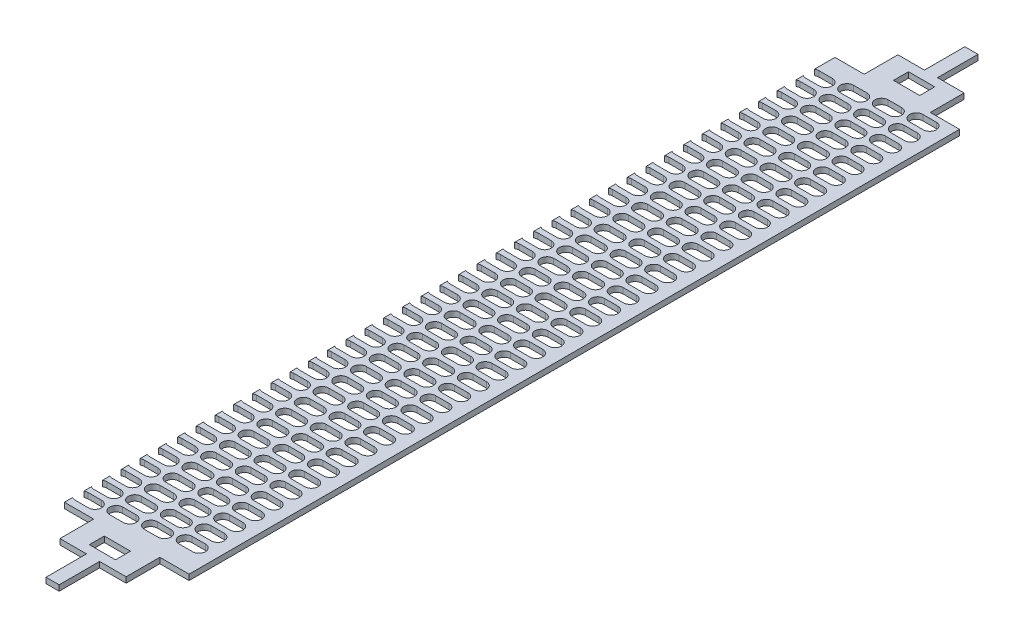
from build123d import *

# Parameters (mm, degrees)
CROQUIS1_W              = 14
CROQUIS1_H              = 8
SALIENTE_EXTRUIR1_DEPTH = 3


with BuildPart() as part:
    # Croquis1 → Saliente-Extruir1 (new body)
    with BuildSketch(Plane(origin=(0, 0, 0), x_dir=(1, 0, 0), z_dir=(0, 1, 0))):
        with BuildLine():
            Line((15.6, 411.2), (15.6, 429.2))
            Line((15.6, 429.2), (29.75, 429.2))
            Line((29.75, 429.2), (29.75, 450.8))
            Line((29.75, 450.8), (36.75, 450.8))
            Line((36.75, 450.8), (36.75, 429.2))
            Line((36.75, 429.2), (50.9, 429.2))
            Line((50.9, 429.2), (50.9, 411.2))
            Line((50.9, 411.2), (66.5, 411.2))
            Line((66.5, 411.2), (66.5, 0))
            Line((66.5, 0), (50.9, 0))
            Line((50.9, 0), (50.9, -18))
            Line((50.9, -18), (36.75, -18))
            Line((36.75, -18), (36.75, -39.6))
            Line((36.75, -39.6), (29.75, -39.6))
            Line((29.75, -39.6), (29.75, -18))
            Line((29.75, -18), (15.6, -18))
            Line((15.6, -18), (15.6, 0))
            Line((15.6, 0), (0, 0))
            Line((0, 0), (0, 4.298333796))
            ThreePointArc((0, 4.298333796), (0.866145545, 3.926883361), (1.8, 3.8))
            Line((1.8, 3.8), (9, 3.8))
            ThreePointArc((9, 3.8), (12.5, 7.3), (9, 10.8))
            Line((9, 10.8), (1.8, 10.8))
            ThreePointArc((1.8, 10.8), (0.866145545, 10.673116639), (0, 10.301666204))
            Line((0, 10.301666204), (0, 14.298333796))
            ThreePointArc((0, 14.298333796), (0.866145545, 13.926883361), (1.8, 13.8))
            Line((1.8, 13.8), (9, 13.8))
            ThreePointArc((9, 13.8), (12.5, 17.3), (9, 20.8))
            Line((9, 20.8), (1.8, 20.8))
            ThreePointArc((1.8, 20.8), (0.866145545, 20.673116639), (0, 20.301666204))
            Line((0, 20.301666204), (0, 24.298333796))
            ThreePointArc((0, 24.298333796), (0.866145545, 23.926883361), (1.8, 23.8))
            Line((1.8, 23.8), (9, 23.8))
            ThreePointArc((9, 23.8), (12.5, 27.3), (9, 30.8))
            Line((9, 30.8), (1.8, 30.8))
            ThreePointArc((1.8, 30.8), (0.866145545, 30.673116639), (0, 30.301666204))
            Line((0, 30.301666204), (0, 34.298333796))
            ThreePointArc((0, 34.298333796), (0.866145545, 33.926883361), (1.8, 33.8))
            Line((1.8, 33.8), (9, 33.8))
            ThreePointArc((9, 33.8), (12.5, 37.3), (9, 40.8))
            Line((9, 40.8), (1.8, 40.8))
            ThreePointArc((1.8, 40.8), (0.866145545, 40.673116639), (0, 40.301666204))
            Line((0, 40.301666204), (0, 44.298333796))
            ThreePointArc((0, 44.298333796), (0.866145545, 43.926883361), (1.8, 43.8))
            Line((1.8, 43.8), (9, 43.8))
            ThreePointArc((9, 43.8), (12.5, 47.3), (9, 50.8))
            Line((9, 50.8), (1.8, 50.8))
            ThreePointArc((1.8, 50.8), (0.866145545, 50.673116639), (0, 50.301666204))
            Line((0, 50.301666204), (0, 54.298333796))
            ThreePointArc((0, 54.298333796), (0.866145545, 53.926883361), (1.8, 53.8))
            Line((1.8, 53.8), (9, 53.8))
            ThreePointArc((9, 53.8), (12.5, 57.3), (9, 60.8))
            Line((9, 60.8), (1.8, 60.8))
            ThreePointArc((1.8, 60.8), (0.866145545, 60.673116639), (0, 60.301666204))
            Line((0, 60.301666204), (0, 64.298333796))
            ThreePointArc((0, 64.298333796), (0.866145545, 63.926883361), (1.8, 63.8))
            Line((1.8, 63.8), (9, 63.8))
            ThreePointArc((9, 63.8), (12.5, 67.3), (9, 70.8))
            Line((9, 70.8), (1.8, 70.8))
            ThreePointArc((1.8, 70.8), (0.866145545, 70.673116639), (0, 70.301666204))
            Line((0, 70.301666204), (0, 74.298333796))
            ThreePointArc((0, 74.298333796), (0.866145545, 73.926883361), (1.8, 73.8))
            Line((1.8, 73.8), (9, 73.8))
            ThreePointArc((9, 73.8), (12.5, 77.3), (9, 80.8))
            Line((9, 80.8), (1.8, 80.8))
            ThreePointArc((1.8, 80.8), (0.866145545, 80.673116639), (0, 80.301666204))
            Line((0, 80.301666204), (0, 84.298333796))
            ThreePointArc((0, 84.298333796), (0.866145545, 83.926883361), (1.8, 83.8))
            Line((1.8, 83.8), (9, 83.8))
            ThreePointArc((9, 83.8), (12.5, 87.3), (9, 90.8))
            Line((9, 90.8), (1.8, 90.8))
            ThreePointArc((1.8, 90.8), (0.866145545, 90.673116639), (0, 90.301666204))
            Line((0, 90.301666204), (0, 94.298333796))
            ThreePointArc((0, 94.298333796), (0.866145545, 93.926883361), (1.8, 93.8))
            Line((1.8, 93.8), (9, 93.8))
            ThreePointArc((9, 93.8), (12.5, 97.3), (9, 100.8))
            Line((9, 100.8), (1.8, 100.8))
            ThreePointArc((1.8, 100.8), (0.866145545, 100.673116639), (0, 100.301666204))
            Line((0, 100.301666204), (0, 104.298333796))
            ThreePointArc((0, 104.298333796), (0.866145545, 103.926883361), (1.8, 103.8))
            Line((1.8, 103.8), (9, 103.8))
            ThreePointArc((9, 103.8), (12.5, 107.3), (9, 110.8))
            Line((9, 110.8), (1.8, 110.8))
            ThreePointArc((1.8, 110.8), (0.866145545, 110.673116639), (0, 110.301666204))
            Line((0, 110.301666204), (0, 114.298333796))
            ThreePointArc((0, 114.298333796), (0.866145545, 113.926883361), (1.8, 113.8))
            Line((1.8, 113.8), (9, 113.8))
            ThreePointArc((9, 113.8), (12.5, 117.3), (9, 120.8))
            Line((9, 120.8), (1.8, 120.8))
            ThreePointArc((1.8, 120.8), (0.866145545, 120.673116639), (0, 120.301666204))
            Line((0, 120.301666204), (0, 124.298333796))
            ThreePointArc((0, 124.298333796), (0.866145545, 123.926883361), (1.8, 123.8))
            Line((1.8, 123.8), (9, 123.8))
            ThreePointArc((9, 123.8), (12.5, 127.3), (9, 130.8))
            Line((9, 130.8), (1.8, 130.8))
            ThreePointArc((1.8, 130.8), (0.866145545, 130.673116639), (0, 130.301666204))
            Line((0, 130.301666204), (0, 134.298333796))
            ThreePointArc((0, 134.298333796), (0.866145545, 133.926883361), (1.8, 133.8))
            Line((1.8, 133.8), (9, 133.8))
            ThreePointArc((9, 133.8), (12.5, 137.3), (9, 140.8))
            Line((9, 140.8), (1.8, 140.8))
            ThreePointArc((1.8, 140.8), (0.866145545, 140.673116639), (0, 140.301666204))
            Line((0, 140.301666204), (0, 144.298333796))
            ThreePointArc((0, 144.298333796), (0.866145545, 143.926883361), (1.8, 143.8))
            Line((1.8, 143.8), (9, 143.8))
            ThreePointArc((9, 143.8), (12.5, 147.3), (9, 150.8))
            Line((9, 150.8), (1.8, 150.8))
            ThreePointArc((1.8, 150.8), (0.866145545, 150.673116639), (0, 150.301666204))
            Line((0, 150.301666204), (0, 154.298333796))
            ThreePointArc((0, 154.298333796), (0.866145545, 153.926883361), (1.8, 153.8))
            Line((1.8, 153.8), (9, 153.8))
            ThreePointArc((9, 153.8), (12.5, 157.3), (9, 160.8))
            Line((9, 160.8), (1.8, 160.8))
            ThreePointArc((1.8, 160.8), (0.866145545, 160.673116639), (0, 160.301666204))
            Line((0, 160.301666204), (0, 164.298333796))
            ThreePointArc((0, 164.298333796), (0.866145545, 163.926883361), (1.8, 163.8))
            Line((1.8, 163.8), (9, 163.8))
            ThreePointArc((9, 163.8), (12.5, 167.3), (9, 170.8))
            Line((9, 170.8), (1.8, 170.8))
            ThreePointArc((1.8, 170.8), (0.866145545, 170.673116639), (0, 170.301666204))
            Line((0, 170.301666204), (0, 174.298333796))
            ThreePointArc((0, 174.298333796), (0.866145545, 173.926883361), (1.8, 173.8))
            Line((1.8, 173.8), (9, 173.8))
            ThreePointArc((9, 173.8), (12.5, 177.3), (9, 180.8))
            Line((9, 180.8), (1.8, 180.8))
            ThreePointArc((1.8, 180.8), (0.866145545, 180.673116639), (0, 180.301666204))
            Line((0, 180.301666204), (0, 184.298333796))
            ThreePointArc((0, 184.298333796), (0.866145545, 183.926883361), (1.8, 183.8))
            Line((1.8, 183.8), (9, 183.8))
            ThreePointArc((9, 183.8), (12.5, 187.3), (9, 190.8))
            Line((9, 190.8), (1.8, 190.8))
            ThreePointArc((1.8, 190.8), (0.866145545, 190.673116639), (0, 190.301666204))
            Line((0, 190.301666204), (0, 194.298333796))
            ThreePointArc((0, 194.298333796), (0.866145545, 193.926883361), (1.8, 193.8))
            Line((1.8, 193.8), (9, 193.8))
            ThreePointArc((9, 193.8), (12.5, 197.3), (9, 200.8))
            Line((9, 200.8), (1.8, 200.8))
            ThreePointArc((1.8, 200.8), (0.866145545, 200.673116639), (0, 200.301666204))
            Line((0, 200.301666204), (0, 204.298333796))
            ThreePointArc((0, 204.298333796), (0.866145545, 203.926883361), (1.8, 203.8))
            Line((1.8, 203.8), (9, 203.8))
            ThreePointArc((9, 203.8), (12.5, 207.3), (9, 210.8))
            Line((9, 210.8), (1.8, 210.8))
            ThreePointArc((1.8, 210.8), (0.866145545, 210.673116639), (0, 210.301666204))
            Line((0, 210.301666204), (0, 214.298333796))
            ThreePointArc((0, 214.298333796), (0.866145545, 213.926883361), (1.8, 213.8))
            Line((1.8, 213.8), (9, 213.8))
            ThreePointArc((9, 213.8), (12.5, 217.3), (9, 220.8))
            Line((9, 220.8), (1.8, 220.8))
            ThreePointArc((1.8, 220.8), (0.866145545, 220.673116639), (0, 220.301666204))
            Line((0, 220.301666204), (0, 224.298333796))
            ThreePointArc((0, 224.298333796), (0.866145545, 223.926883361), (1.8, 223.8))
            Line((1.8, 223.8), (9, 223.8))
            ThreePointArc((9, 223.8), (12.5, 227.3), (9, 230.8))
            Line((9, 230.8), (1.8, 230.8))
            ThreePointArc((1.8, 230.8), (0.866145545, 230.673116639), (0, 230.301666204))
            Line((0, 230.301666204), (0, 234.298333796))
            ThreePointArc((0, 234.298333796), (0.866145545, 233.926883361), (1.8, 233.8))
            Line((1.8, 233.8), (9, 233.8))
            ThreePointArc((9, 233.8), (12.5, 237.3), (9, 240.8))
            Line((9, 240.8), (1.8, 240.8))
            ThreePointArc((1.8, 240.8), (0.866145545, 240.673116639), (0, 240.301666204))
            Line((0, 240.301666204), (0, 244.298333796))
            ThreePointArc((0, 244.298333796), (0.866145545, 243.926883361), (1.8, 243.8))
            Line((1.8, 243.8), (9, 243.8))
            ThreePointArc((9, 243.8), (12.5, 247.3), (9, 250.8))
            Line((9, 250.8), (1.8, 250.8))
            ThreePointArc((1.8, 250.8), (0.866145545, 250.673116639), (0, 250.301666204))
            Line((0, 250.301666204), (0, 254.298333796))
            ThreePointArc((0, 254.298333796), (0.866145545, 253.926883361), (1.8, 253.8))
            Line((1.8, 253.8), (9, 253.8))
            ThreePointArc((9, 253.8), (12.5, 257.3), (9, 260.8))
            Line((9, 260.8), (1.8, 260.8))
            ThreePointArc((1.8, 260.8), (0.866145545, 260.673116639), (0, 260.301666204))
            Line((0, 260.301666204), (0, 264.298333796))
            ThreePointArc((0, 264.298333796), (0.866145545, 263.926883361), (1.8, 263.8))
            Line((1.8, 263.8), (9, 263.8))
            ThreePointArc((9, 263.8), (12.5, 267.3), (9, 270.8))
            Line((9, 270.8), (1.8, 270.8))
            ThreePointArc((1.8, 270.8), (0.866145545, 270.673116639), (0, 270.301666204))
            Line((0, 270.301666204), (0, 274.298333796))
            ThreePointArc((0, 274.298333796), (0.866145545, 273.926883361), (1.8, 273.8))
            Line((1.8, 273.8), (9, 273.8))
            ThreePointArc((9, 273.8), (12.5, 277.3), (9, 280.8))
            Line((9, 280.8), (1.8, 280.8))
            ThreePointArc((1.8, 280.8), (0.866145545, 280.673116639), (0, 280.301666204))
            Line((0, 280.301666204), (0, 284.298333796))
            ThreePointArc((0, 284.298333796), (0.866145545, 283.926883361), (1.8, 283.8))
            Line((1.8, 283.8), (9, 283.8))
            ThreePointArc((9, 283.8), (12.5, 287.3), (9, 290.8))
            Line((9, 290.8), (1.8, 290.8))
            ThreePointArc((1.8, 290.8), (0.866145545, 290.673116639), (0, 290.301666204))
            Line((0, 290.301666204), (0, 294.298333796))
            ThreePointArc((0, 294.298333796), (0.866145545, 293.926883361), (1.8, 293.8))
            Line((1.8, 293.8), (9, 293.8))
            ThreePointArc((9, 293.8), (12.5, 297.3), (9, 300.8))
            Line((9, 300.8), (1.8, 300.8))
            ThreePointArc((1.8, 300.8), (0.866145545, 300.673116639), (0, 300.301666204))
            Line((0, 300.301666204), (0, 304.298333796))
            ThreePointArc((0, 304.298333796), (0.866145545, 303.926883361), (1.8, 303.8))
            Line((1.8, 303.8), (9, 303.8))
            ThreePointArc((9, 303.8), (12.5, 307.3), (9, 310.8))
            Line((9, 310.8), (1.8, 310.8))
            ThreePointArc((1.8, 310.8), (0.866145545, 310.673116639), (0, 310.301666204))
            Line((0, 310.301666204), (0, 314.298333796))
            ThreePointArc((0, 314.298333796), (0.866145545, 313.926883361), (1.8, 313.8))
            Line((1.8, 313.8), (9, 313.8))
            ThreePointArc((9, 313.8), (12.5, 317.3), (9, 320.8))
            Line((9, 320.8), (1.8, 320.8))
            ThreePointArc((1.8, 320.8), (0.866145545, 320.673116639), (0, 320.301666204))
            Line((0, 320.301666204), (0, 324.298333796))
            ThreePointArc((0, 324.298333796), (0.866145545, 323.926883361), (1.8, 323.8))
            Line((1.8, 323.8), (9, 323.8))
            ThreePointArc((9, 323.8), (12.5, 327.3), (9, 330.8))
            Line((9, 330.8), (1.8, 330.8))
            ThreePointArc((1.8, 330.8), (0.866145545, 330.673116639), (0, 330.301666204))
            Line((0, 330.301666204), (0, 334.298333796))
            ThreePointArc((0, 334.298333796), (0.866145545, 333.926883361), (1.8, 333.8))
            Line((1.8, 333.8), (9, 333.8))
            ThreePointArc((9, 333.8), (12.5, 337.3), (9, 340.8))
            Line((9, 340.8), (1.8, 340.8))
            ThreePointArc((1.8, 340.8), (0.866145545, 340.673116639), (0, 340.301666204))
            Line((0, 340.301666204), (0, 344.298333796))
            ThreePointArc((0, 344.298333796), (0.866145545, 343.926883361), (1.8, 343.8))
            Line((1.8, 343.8), (9, 343.8))
            ThreePointArc((9, 343.8), (12.5, 347.3), (9, 350.8))
            Line((9, 350.8), (1.8, 350.8))
            ThreePointArc((1.8, 350.8), (0.866145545, 350.673116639), (0, 350.301666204))
            Line((0, 350.301666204), (0, 354.298333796))
            ThreePointArc((0, 354.298333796), (0.866145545, 353.926883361), (1.8, 353.8))
            Line((1.8, 353.8), (9, 353.8))
            ThreePointArc((9, 353.8), (12.5, 357.3), (9, 360.8))
            Line((9, 360.8), (1.8, 360.8))
            ThreePointArc((1.8, 360.8), (0.866145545, 360.673116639), (0, 360.301666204))
            Line((0, 360.301666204), (0, 364.298333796))
            ThreePointArc((0, 364.298333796), (0.866145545, 363.926883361), (1.8, 363.8))
            Line((1.8, 363.8), (9, 363.8))
            ThreePointArc((9, 363.8), (12.5, 367.3), (9, 370.8))
            Line((9, 370.8), (1.8, 370.8))
            ThreePointArc((1.8, 370.8), (0.866145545, 370.673116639), (0, 370.301666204))
            Line((0, 370.301666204), (0, 374.298333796))
            ThreePointArc((0, 374.298333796), (0.866145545, 373.926883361), (1.8, 373.8))
            Line((1.8, 373.8), (9, 373.8))
            ThreePointArc((9, 373.8), (12.5, 377.3), (9, 380.8))
            Line((9, 380.8), (1.8, 380.8))
            ThreePointArc((1.8, 380.8), (0.866145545, 380.673116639), (0, 380.301666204))
            Line((0, 380.301666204), (0, 384.298333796))
            ThreePointArc((0, 384.298333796), (0.866145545, 383.926883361), (1.8, 383.8))
            Line((1.8, 383.8), (9, 383.8))
            ThreePointArc((9, 383.8), (12.5, 387.3), (9, 390.8))
            Line((9, 390.8), (1.8, 390.8))
            ThreePointArc((1.8, 390.8), (0.866145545, 390.673116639), (0, 390.301666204))
            Line((0, 390.301666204), (0, 394.298333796))
            ThreePointArc((0, 394.298333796), (0.866145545, 393.926883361), (1.8, 393.8))
            Line((1.8, 393.8), (9, 393.8))
            ThreePointArc((9, 393.8), (12.5, 397.3), (9, 400.8))
            Line((9, 400.8), (1.8, 400.8))
            ThreePointArc((1.8, 400.8), (0.866145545, 400.673116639), (0, 400.301666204))
            Line((0, 400.301666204), (0, 411.2))
            Line((0, 411.2), (15.6, 411.2))
        make_face()
        with Locations((33.25, 420.2)):
            Rectangle(CROQUIS1_W, CROQUIS1_H, mode=Mode.SUBTRACT)
        with BuildLine():
            Line((49.8, 408.3), (57, 408.3))
            ThreePointArc((57, 408.3), (60.5, 404.8), (57, 401.3))
            Line((57, 401.3), (49.8, 401.3))
            ThreePointArc((49.8, 401.3), (46.3, 404.8), (49.8, 408.3))
        make_face(mode=Mode.SUBTRACT)
        with Locations((33.25, -9)):
            Rectangle(CROQUIS1_W, CROQUIS1_H, mode=Mode.SUBTRACT)
        with BuildLine():
            Line((33.8, 398.8), (41, 398.8))
            ThreePointArc((41, 398.8), (44.5, 402.3), (41, 405.8))
            Line((41, 405.8), (33.8, 405.8))
            ThreePointArc((33.8, 405.8), (30.3, 402.3), (33.8, 398.8))
        make_face(mode=Mode.SUBTRACT)
        with BuildLine():
            Line((17.8, 396.3), (25, 396.3))
            ThreePointArc((25, 396.3), (28.5, 399.8), (25, 403.3))
            Line((25, 403.3), (17.8, 403.3))
            ThreePointArc((17.8, 403.3), (14.3, 399.8), (17.8, 396.3))
        make_face(mode=Mode.SUBTRACT)
        with BuildLine():
            Line((49.8, 398.3), (57, 398.3))
            ThreePointArc((57, 398.3), (60.5, 394.8), (57, 391.3))
            Line((57, 391.3), (49.8, 391.3))
            ThreePointArc((49.8, 391.3), (46.3, 394.8), (49.8, 398.3))
        make_face(mode=Mode.SUBTRACT)
        with BuildLine():
            Line((33.8, 395.8), (41, 395.8))
            ThreePointArc((41, 395.8), (44.5, 392.3), (41, 388.8))
            Line((41, 388.8), (33.8, 388.8))
            ThreePointArc((33.8, 388.8), (30.3, 392.3), (33.8, 395.8))
        make_face(mode=Mode.SUBTRACT)
        with BuildLine():
            Line((17.8, 393.3), (25, 393.3))
            ThreePointArc((25, 393.3), (28.5, 389.8), (25, 386.3))
            Line((25, 386.3), (17.8, 386.3))
            ThreePointArc((17.8, 386.3), (14.3, 389.8), (17.8, 393.3))
        make_face(mode=Mode.SUBTRACT)
        with BuildLine():
            Line((49.8, 388.3), (57, 388.3))
            ThreePointArc((57, 388.3), (60.5, 384.8), (57, 381.3))
            Line((57, 381.3), (49.8, 381.3))
            ThreePointArc((49.8, 381.3), (46.3, 384.8), (49.8, 388.3))
        make_face(mode=Mode.SUBTRACT)
        with BuildLine():
            Line((33.8, 385.8), (41, 385.8))
            ThreePointArc((41, 385.8), (44.5, 382.3), (41, 378.8))
            Line((41, 378.8), (33.8, 378.8))
            ThreePointArc((33.8, 378.8), (30.3, 382.3), (33.8, 385.8))
        make_face(mode=Mode.SUBTRACT)
        with BuildLine():
            Line((17.8, 383.3), (25, 383.3))
            ThreePointArc((25, 383.3), (28.5, 379.8), (25, 376.3))
            Line((25, 376.3), (17.8, 376.3))
            ThreePointArc((17.8, 376.3), (14.3, 379.8), (17.8, 383.3))
        make_face(mode=Mode.SUBTRACT)
        with BuildLine():
            Line((49.8, 378.3), (57, 378.3))
            ThreePointArc((57, 378.3), (60.5, 374.8), (57, 371.3))
            Line((57, 371.3), (49.8, 371.3))
            ThreePointArc((49.8, 371.3), (46.3, 374.8), (49.8, 378.3))
        make_face(mode=Mode.SUBTRACT)
        with BuildLine():
            Line((33.8, 375.8), (41, 375.8))
            ThreePointArc((41, 375.8), (44.5, 372.3), (41, 368.8))
            Line((41, 368.8), (33.8, 368.8))
            ThreePointArc((33.8, 368.8), (30.3, 372.3), (33.8, 375.8))
        make_face(mode=Mode.SUBTRACT)
        with BuildLine():
            Line((17.8, 373.3), (25, 373.3))
            ThreePointArc((25, 373.3), (28.5, 369.8), (25, 366.3))
            Line((25, 366.3), (17.8, 366.3))
            ThreePointArc((17.8, 366.3), (14.3, 369.8), (17.8, 373.3))
        make_face(mode=Mode.SUBTRACT)
        with BuildLine():
            Line((49.8, 368.3), (57, 368.3))
            ThreePointArc((57, 368.3), (60.5, 364.8), (57, 361.3))
            Line((57, 361.3), (49.8, 361.3))
            ThreePointArc((49.8, 361.3), (46.3, 364.8), (49.8, 368.3))
        make_face(mode=Mode.SUBTRACT)
        with BuildLine():
            Line((33.8, 365.8), (41, 365.8))
            ThreePointArc((41, 365.8), (44.5, 362.3), (41, 358.8))
            Line((41, 358.8), (33.8, 358.8))
            ThreePointArc((33.8, 358.8), (30.3, 362.3), (33.8, 365.8))
        make_face(mode=Mode.SUBTRACT)
        with BuildLine():
            Line((17.8, 363.3), (25, 363.3))
            ThreePointArc((25, 363.3), (28.5, 359.8), (25, 356.3))
            Line((25, 356.3), (17.8, 356.3))
            ThreePointArc((17.8, 356.3), (14.3, 359.8), (17.8, 363.3))
        make_face(mode=Mode.SUBTRACT)
        with BuildLine():
            Line((49.8, 358.3), (57, 358.3))
            ThreePointArc((57, 358.3), (60.5, 354.8), (57, 351.3))
            Line((57, 351.3), (49.8, 351.3))
            ThreePointArc((49.8, 351.3), (46.3, 354.8), (49.8, 358.3))
        make_face(mode=Mode.SUBTRACT)
        with BuildLine():
            Line((33.8, 355.8), (41, 355.8))
            ThreePointArc((41, 355.8), (44.5, 352.3), (41, 348.8))
            Line((41, 348.8), (33.8, 348.8))
            ThreePointArc((33.8, 348.8), (30.3, 352.3), (33.8, 355.8))
        make_face(mode=Mode.SUBTRACT)
        with BuildLine():
            Line((17.8, 353.3), (25, 353.3))
            ThreePointArc((25, 353.3), (28.5, 349.8), (25, 346.3))
            Line((25, 346.3), (17.8, 346.3))
            ThreePointArc((17.8, 346.3), (14.3, 349.8), (17.8, 353.3))
        make_face(mode=Mode.SUBTRACT)
        with BuildLine():
            Line((49.8, 348.3), (57, 348.3))
            ThreePointArc((57, 348.3), (60.5, 344.8), (57, 341.3))
            Line((57, 341.3), (49.8, 341.3))
            ThreePointArc((49.8, 341.3), (46.3, 344.8), (49.8, 348.3))
        make_face(mode=Mode.SUBTRACT)
        with BuildLine():
            Line((33.8, 345.8), (41, 345.8))
            ThreePointArc((41, 345.8), (44.5, 342.3), (41, 338.8))
            Line((41, 338.8), (33.8, 338.8))
            ThreePointArc((33.8, 338.8), (30.3, 342.3), (33.8, 345.8))
        make_face(mode=Mode.SUBTRACT)
        with BuildLine():
            Line((17.8, 343.3), (25, 343.3))
            ThreePointArc((25, 343.3), (28.5, 339.8), (25, 336.3))
            Line((25, 336.3), (17.8, 336.3))
            ThreePointArc((17.8, 336.3), (14.3, 339.8), (17.8, 343.3))
        make_face(mode=Mode.SUBTRACT)
        with BuildLine():
            Line((49.8, 338.3), (57, 338.3))
            ThreePointArc((57, 338.3), (60.5, 334.8), (57, 331.3))
            Line((57, 331.3), (49.8, 331.3))
            ThreePointArc((49.8, 331.3), (46.3, 334.8), (49.8, 338.3))
        make_face(mode=Mode.SUBTRACT)
        with BuildLine():
            Line((33.8, 335.8), (41, 335.8))
            ThreePointArc((41, 335.8), (44.5, 332.3), (41, 328.8))
            Line((41, 328.8), (33.8, 328.8))
            ThreePointArc((33.8, 328.8), (30.3, 332.3), (33.8, 335.8))
        make_face(mode=Mode.SUBTRACT)
        with BuildLine():
            Line((17.8, 333.3), (25, 333.3))
            ThreePointArc((25, 333.3), (28.5, 329.8), (25, 326.3))
            Line((25, 326.3), (17.8, 326.3))
            ThreePointArc((17.8, 326.3), (14.3, 329.8), (17.8, 333.3))
        make_face(mode=Mode.SUBTRACT)
        with BuildLine():
            Line((49.8, 328.3), (57, 328.3))
            ThreePointArc((57, 328.3), (60.5, 324.8), (57, 321.3))
            Line((57, 321.3), (49.8, 321.3))
            ThreePointArc((49.8, 321.3), (46.3, 324.8), (49.8, 328.3))
        make_face(mode=Mode.SUBTRACT)
        with BuildLine():
            Line((33.8, 325.8), (41, 325.8))
            ThreePointArc((41, 325.8), (44.5, 322.3), (41, 318.8))
            Line((41, 318.8), (33.8, 318.8))
            ThreePointArc((33.8, 318.8), (30.3, 322.3), (33.8, 325.8))
        make_face(mode=Mode.SUBTRACT)
        with BuildLine():
            Line((17.8, 323.3), (25, 323.3))
            ThreePointArc((25, 323.3), (28.5, 319.8), (25, 316.3))
            Line((25, 316.3), (17.8, 316.3))
            ThreePointArc((17.8, 316.3), (14.3, 319.8), (17.8, 323.3))
        make_face(mode=Mode.SUBTRACT)
        with BuildLine():
            Line((49.8, 318.3), (57, 318.3))
            ThreePointArc((57, 318.3), (60.5, 314.8), (57, 311.3))
            Line((57, 311.3), (49.8, 311.3))
            ThreePointArc((49.8, 311.3), (46.3, 314.8), (49.8, 318.3))
        make_face(mode=Mode.SUBTRACT)
        with BuildLine():
            Line((33.8, 315.8), (41, 315.8))
            ThreePointArc((41, 315.8), (44.5, 312.3), (41, 308.8))
            Line((41, 308.8), (33.8, 308.8))
            ThreePointArc((33.8, 308.8), (30.3, 312.3), (33.8, 315.8))
        make_face(mode=Mode.SUBTRACT)
        with BuildLine():
            Line((17.8, 313.3), (25, 313.3))
            ThreePointArc((25, 313.3), (28.5, 309.8), (25, 306.3))
            Line((25, 306.3), (17.8, 306.3))
            ThreePointArc((17.8, 306.3), (14.3, 309.8), (17.8, 313.3))
        make_face(mode=Mode.SUBTRACT)
        with BuildLine():
            Line((49.8, 308.3), (57, 308.3))
            ThreePointArc((57, 308.3), (60.5, 304.8), (57, 301.3))
            Line((57, 301.3), (49.8, 301.3))
            ThreePointArc((49.8, 301.3), (46.3, 304.8), (49.8, 308.3))
        make_face(mode=Mode.SUBTRACT)
        with BuildLine():
            Line((33.8, 305.8), (41, 305.8))
            ThreePointArc((41, 305.8), (44.5, 302.3), (41, 298.8))
            Line((41, 298.8), (33.8, 298.8))
            ThreePointArc((33.8, 298.8), (30.3, 302.3), (33.8, 305.8))
        make_face(mode=Mode.SUBTRACT)
        with BuildLine():
            Line((17.8, 303.3), (25, 303.3))
            ThreePointArc((25, 303.3), (28.5, 299.8), (25, 296.3))
            Line((25, 296.3), (17.8, 296.3))
            ThreePointArc((17.8, 296.3), (14.3, 299.8), (17.8, 303.3))
        make_face(mode=Mode.SUBTRACT)
        with BuildLine():
            Line((49.8, 298.3), (57, 298.3))
            ThreePointArc((57, 298.3), (60.5, 294.8), (57, 291.3))
            Line((57, 291.3), (49.8, 291.3))
            ThreePointArc((49.8, 291.3), (46.3, 294.8), (49.8, 298.3))
        make_face(mode=Mode.SUBTRACT)
        with BuildLine():
            Line((33.8, 295.8), (41, 295.8))
            ThreePointArc((41, 295.8), (44.5, 292.3), (41, 288.8))
            Line((41, 288.8), (33.8, 288.8))
            ThreePointArc((33.8, 288.8), (30.3, 292.3), (33.8, 295.8))
        make_face(mode=Mode.SUBTRACT)
        with BuildLine():
            Line((17.8, 293.3), (25, 293.3))
            ThreePointArc((25, 293.3), (28.5, 289.8), (25, 286.3))
            Line((25, 286.3), (17.8, 286.3))
            ThreePointArc((17.8, 286.3), (14.3, 289.8), (17.8, 293.3))
        make_face(mode=Mode.SUBTRACT)
        with BuildLine():
            Line((49.8, 288.3), (57, 288.3))
            ThreePointArc((57, 288.3), (60.5, 284.8), (57, 281.3))
            Line((57, 281.3), (49.8, 281.3))
            ThreePointArc((49.8, 281.3), (46.3, 284.8), (49.8, 288.3))
        make_face(mode=Mode.SUBTRACT)
        with BuildLine():
            Line((33.8, 285.8), (41, 285.8))
            ThreePointArc((41, 285.8), (44.5, 282.3), (41, 278.8))
            Line((41, 278.8), (33.8, 278.8))
            ThreePointArc((33.8, 278.8), (30.3, 282.3), (33.8, 285.8))
        make_face(mode=Mode.SUBTRACT)
        with BuildLine():
            Line((17.8, 283.3), (25, 283.3))
            ThreePointArc((25, 283.3), (28.5, 279.8), (25, 276.3))
            Line((25, 276.3), (17.8, 276.3))
            ThreePointArc((17.8, 276.3), (14.3, 279.8), (17.8, 283.3))
        make_face(mode=Mode.SUBTRACT)
        with BuildLine():
            Line((49.8, 278.3), (57, 278.3))
            ThreePointArc((57, 278.3), (60.5, 274.8), (57, 271.3))
            Line((57, 271.3), (49.8, 271.3))
            ThreePointArc((49.8, 271.3), (46.3, 274.8), (49.8, 278.3))
        make_face(mode=Mode.SUBTRACT)
        with BuildLine():
            Line((33.8, 275.8), (41, 275.8))
            ThreePointArc((41, 275.8), (44.5, 272.3), (41, 268.8))
            Line((41, 268.8), (33.8, 268.8))
            ThreePointArc((33.8, 268.8), (30.3, 272.3), (33.8, 275.8))
        make_face(mode=Mode.SUBTRACT)
        with BuildLine():
            Line((17.8, 273.3), (25, 273.3))
            ThreePointArc((25, 273.3), (28.5, 269.8), (25, 266.3))
            Line((25, 266.3), (17.8, 266.3))
            ThreePointArc((17.8, 266.3), (14.3, 269.8), (17.8, 273.3))
        make_face(mode=Mode.SUBTRACT)
        with BuildLine():
            Line((49.8, 268.3), (57, 268.3))
            ThreePointArc((57, 268.3), (60.5, 264.8), (57, 261.3))
            Line((57, 261.3), (49.8, 261.3))
            ThreePointArc((49.8, 261.3), (46.3, 264.8), (49.8, 268.3))
        make_face(mode=Mode.SUBTRACT)
        with BuildLine():
            Line((33.8, 265.8), (41, 265.8))
            ThreePointArc((41, 265.8), (44.5, 262.3), (41, 258.8))
            Line((41, 258.8), (33.8, 258.8))
            ThreePointArc((33.8, 258.8), (30.3, 262.3), (33.8, 265.8))
        make_face(mode=Mode.SUBTRACT)
        with BuildLine():
            Line((17.8, 263.3), (25, 263.3))
            ThreePointArc((25, 263.3), (28.5, 259.8), (25, 256.3))
            Line((25, 256.3), (17.8, 256.3))
            ThreePointArc((17.8, 256.3), (14.3, 259.8), (17.8, 263.3))
        make_face(mode=Mode.SUBTRACT)
        with BuildLine():
            Line((49.8, 258.3), (57, 258.3))
            ThreePointArc((57, 258.3), (60.5, 254.8), (57, 251.3))
            Line((57, 251.3), (49.8, 251.3))
            ThreePointArc((49.8, 251.3), (46.3, 254.8), (49.8, 258.3))
        make_face(mode=Mode.SUBTRACT)
        with BuildLine():
            Line((33.8, 255.8), (41, 255.8))
            ThreePointArc((41, 255.8), (44.5, 252.3), (41, 248.8))
            Line((41, 248.8), (33.8, 248.8))
            ThreePointArc((33.8, 248.8), (30.3, 252.3), (33.8, 255.8))
        make_face(mode=Mode.SUBTRACT)
        with BuildLine():
            Line((17.8, 253.3), (25, 253.3))
            ThreePointArc((25, 253.3), (28.5, 249.8), (25, 246.3))
            Line((25, 246.3), (17.8, 246.3))
            ThreePointArc((17.8, 246.3), (14.3, 249.8), (17.8, 253.3))
        make_face(mode=Mode.SUBTRACT)
        with BuildLine():
            Line((49.8, 248.3), (57, 248.3))
            ThreePointArc((57, 248.3), (60.5, 244.8), (57, 241.3))
            Line((57, 241.3), (49.8, 241.3))
            ThreePointArc((49.8, 241.3), (46.3, 244.8), (49.8, 248.3))
        make_face(mode=Mode.SUBTRACT)
        with BuildLine():
            Line((33.8, 245.8), (41, 245.8))
            ThreePointArc((41, 245.8), (44.5, 242.3), (41, 238.8))
            Line((41, 238.8), (33.8, 238.8))
            ThreePointArc((33.8, 238.8), (30.3, 242.3), (33.8, 245.8))
        make_face(mode=Mode.SUBTRACT)
        with BuildLine():
            Line((17.8, 243.3), (25, 243.3))
            ThreePointArc((25, 243.3), (28.5, 239.8), (25, 236.3))
            Line((25, 236.3), (17.8, 236.3))
            ThreePointArc((17.8, 236.3), (14.3, 239.8), (17.8, 243.3))
        make_face(mode=Mode.SUBTRACT)
        with BuildLine():
            Line((49.8, 238.3), (57, 238.3))
            ThreePointArc((57, 238.3), (60.5, 234.8), (57, 231.3))
            Line((57, 231.3), (49.8, 231.3))
            ThreePointArc((49.8, 231.3), (46.3, 234.8), (49.8, 238.3))
        make_face(mode=Mode.SUBTRACT)
        with BuildLine():
            Line((33.8, 235.8), (41, 235.8))
            ThreePointArc((41, 235.8), (44.5, 232.3), (41, 228.8))
            Line((41, 228.8), (33.8, 228.8))
            ThreePointArc((33.8, 228.8), (30.3, 232.3), (33.8, 235.8))
        make_face(mode=Mode.SUBTRACT)
        with BuildLine():
            Line((17.8, 233.3), (25, 233.3))
            ThreePointArc((25, 233.3), (28.5, 229.8), (25, 226.3))
            Line((25, 226.3), (17.8, 226.3))
            ThreePointArc((17.8, 226.3), (14.3, 229.8), (17.8, 233.3))
        make_face(mode=Mode.SUBTRACT)
        with BuildLine():
            Line((49.8, 228.3), (57, 228.3))
            ThreePointArc((57, 228.3), (60.5, 224.8), (57, 221.3))
            Line((57, 221.3), (49.8, 221.3))
            ThreePointArc((49.8, 221.3), (46.3, 224.8), (49.8, 228.3))
        make_face(mode=Mode.SUBTRACT)
        with BuildLine():
            Line((33.8, 225.8), (41, 225.8))
            ThreePointArc((41, 225.8), (44.5, 222.3), (41, 218.8))
            Line((41, 218.8), (33.8, 218.8))
            ThreePointArc((33.8, 218.8), (30.3, 222.3), (33.8, 225.8))
        make_face(mode=Mode.SUBTRACT)
        with BuildLine():
            Line((17.8, 223.3), (25, 223.3))
            ThreePointArc((25, 223.3), (28.5, 219.8), (25, 216.3))
            Line((25, 216.3), (17.8, 216.3))
            ThreePointArc((17.8, 216.3), (14.3, 219.8), (17.8, 223.3))
        make_face(mode=Mode.SUBTRACT)
        with BuildLine():
            Line((49.8, 218.3), (57, 218.3))
            ThreePointArc((57, 218.3), (60.5, 214.8), (57, 211.3))
            Line((57, 211.3), (49.8, 211.3))
            ThreePointArc((49.8, 211.3), (46.3, 214.8), (49.8, 218.3))
        make_face(mode=Mode.SUBTRACT)
        with BuildLine():
            Line((33.8, 215.8), (41, 215.8))
            ThreePointArc((41, 215.8), (44.5, 212.3), (41, 208.8))
            Line((41, 208.8), (33.8, 208.8))
            ThreePointArc((33.8, 208.8), (30.3, 212.3), (33.8, 215.8))
        make_face(mode=Mode.SUBTRACT)
        with BuildLine():
            Line((17.8, 213.3), (25, 213.3))
            ThreePointArc((25, 213.3), (28.5, 209.8), (25, 206.3))
            Line((25, 206.3), (17.8, 206.3))
            ThreePointArc((17.8, 206.3), (14.3, 209.8), (17.8, 213.3))
        make_face(mode=Mode.SUBTRACT)
        with BuildLine():
            Line((49.8, 208.3), (57, 208.3))
            ThreePointArc((57, 208.3), (60.5, 204.8), (57, 201.3))
            Line((57, 201.3), (49.8, 201.3))
            ThreePointArc((49.8, 201.3), (46.3, 204.8), (49.8, 208.3))
        make_face(mode=Mode.SUBTRACT)
        with BuildLine():
            Line((33.8, 205.8), (41, 205.8))
            ThreePointArc((41, 205.8), (44.5, 202.3), (41, 198.8))
            Line((41, 198.8), (33.8, 198.8))
            ThreePointArc((33.8, 198.8), (30.3, 202.3), (33.8, 205.8))
        make_face(mode=Mode.SUBTRACT)
        with BuildLine():
            Line((17.8, 203.3), (25, 203.3))
            ThreePointArc((25, 203.3), (28.5, 199.8), (25, 196.3))
            Line((25, 196.3), (17.8, 196.3))
            ThreePointArc((17.8, 196.3), (14.3, 199.8), (17.8, 203.3))
        make_face(mode=Mode.SUBTRACT)
        with BuildLine():
            Line((49.8, 198.3), (57, 198.3))
            ThreePointArc((57, 198.3), (60.5, 194.8), (57, 191.3))
            Line((57, 191.3), (49.8, 191.3))
            ThreePointArc((49.8, 191.3), (46.3, 194.8), (49.8, 198.3))
        make_face(mode=Mode.SUBTRACT)
        with BuildLine():
            Line((33.8, 195.8), (41, 195.8))
            ThreePointArc((41, 195.8), (44.5, 192.3), (41, 188.8))
            Line((41, 188.8), (33.8, 188.8))
            ThreePointArc((33.8, 188.8), (30.3, 192.3), (33.8, 195.8))
        make_face(mode=Mode.SUBTRACT)
        with BuildLine():
            Line((17.8, 193.3), (25, 193.3))
            ThreePointArc((25, 193.3), (28.5, 189.8), (25, 186.3))
            Line((25, 186.3), (17.8, 186.3))
            ThreePointArc((17.8, 186.3), (14.3, 189.8), (17.8, 193.3))
        make_face(mode=Mode.SUBTRACT)
        with BuildLine():
            Line((49.8, 188.3), (57, 188.3))
            ThreePointArc((57, 188.3), (60.5, 184.8), (57, 181.3))
            Line((57, 181.3), (49.8, 181.3))
            ThreePointArc((49.8, 181.3), (46.3, 184.8), (49.8, 188.3))
        make_face(mode=Mode.SUBTRACT)
        with BuildLine():
            Line((33.8, 185.8), (41, 185.8))
            ThreePointArc((41, 185.8), (44.5, 182.3), (41, 178.8))
            Line((41, 178.8), (33.8, 178.8))
            ThreePointArc((33.8, 178.8), (30.3, 182.3), (33.8, 185.8))
        make_face(mode=Mode.SUBTRACT)
        with BuildLine():
            Line((17.8, 183.3), (25, 183.3))
            ThreePointArc((25, 183.3), (28.5, 179.8), (25, 176.3))
            Line((25, 176.3), (17.8, 176.3))
            ThreePointArc((17.8, 176.3), (14.3, 179.8), (17.8, 183.3))
        make_face(mode=Mode.SUBTRACT)
        with BuildLine():
            Line((49.8, 178.3), (57, 178.3))
            ThreePointArc((57, 178.3), (60.5, 174.8), (57, 171.3))
            Line((57, 171.3), (49.8, 171.3))
            ThreePointArc((49.8, 171.3), (46.3, 174.8), (49.8, 178.3))
        make_face(mode=Mode.SUBTRACT)
        with BuildLine():
            Line((33.8, 175.8), (41, 175.8))
            ThreePointArc((41, 175.8), (44.5, 172.3), (41, 168.8))
            Line((41, 168.8), (33.8, 168.8))
            ThreePointArc((33.8, 168.8), (30.3, 172.3), (33.8, 175.8))
        make_face(mode=Mode.SUBTRACT)
        with BuildLine():
            Line((17.8, 173.3), (25, 173.3))
            ThreePointArc((25, 173.3), (28.5, 169.8), (25, 166.3))
            Line((25, 166.3), (17.8, 166.3))
            ThreePointArc((17.8, 166.3), (14.3, 169.8), (17.8, 173.3))
        make_face(mode=Mode.SUBTRACT)
        with BuildLine():
            Line((49.8, 168.3), (57, 168.3))
            ThreePointArc((57, 168.3), (60.5, 164.8), (57, 161.3))
            Line((57, 161.3), (49.8, 161.3))
            ThreePointArc((49.8, 161.3), (46.3, 164.8), (49.8, 168.3))
        make_face(mode=Mode.SUBTRACT)
        with BuildLine():
            Line((33.8, 165.8), (41, 165.8))
            ThreePointArc((41, 165.8), (44.5, 162.3), (41, 158.8))
            Line((41, 158.8), (33.8, 158.8))
            ThreePointArc((33.8, 158.8), (30.3, 162.3), (33.8, 165.8))
        make_face(mode=Mode.SUBTRACT)
        with BuildLine():
            Line((17.8, 163.3), (25, 163.3))
            ThreePointArc((25, 163.3), (28.5, 159.8), (25, 156.3))
            Line((25, 156.3), (17.8, 156.3))
            ThreePointArc((17.8, 156.3), (14.3, 159.8), (17.8, 163.3))
        make_face(mode=Mode.SUBTRACT)
        with BuildLine():
            Line((49.8, 158.3), (57, 158.3))
            ThreePointArc((57, 158.3), (60.5, 154.8), (57, 151.3))
            Line((57, 151.3), (49.8, 151.3))
            ThreePointArc((49.8, 151.3), (46.3, 154.8), (49.8, 158.3))
        make_face(mode=Mode.SUBTRACT)
        with BuildLine():
            Line((33.8, 155.8), (41, 155.8))
            ThreePointArc((41, 155.8), (44.5, 152.3), (41, 148.8))
            Line((41, 148.8), (33.8, 148.8))
            ThreePointArc((33.8, 148.8), (30.3, 152.3), (33.8, 155.8))
        make_face(mode=Mode.SUBTRACT)
        with BuildLine():
            Line((17.8, 153.3), (25, 153.3))
            ThreePointArc((25, 153.3), (28.5, 149.8), (25, 146.3))
            Line((25, 146.3), (17.8, 146.3))
            ThreePointArc((17.8, 146.3), (14.3, 149.8), (17.8, 153.3))
        make_face(mode=Mode.SUBTRACT)
        with BuildLine():
            Line((49.8, 148.3), (57, 148.3))
            ThreePointArc((57, 148.3), (60.5, 144.8), (57, 141.3))
            Line((57, 141.3), (49.8, 141.3))
            ThreePointArc((49.8, 141.3), (46.3, 144.8), (49.8, 148.3))
        make_face(mode=Mode.SUBTRACT)
        with BuildLine():
            Line((33.8, 145.8), (41, 145.8))
            ThreePointArc((41, 145.8), (44.5, 142.3), (41, 138.8))
            Line((41, 138.8), (33.8, 138.8))
            ThreePointArc((33.8, 138.8), (30.3, 142.3), (33.8, 145.8))
        make_face(mode=Mode.SUBTRACT)
        with BuildLine():
            Line((17.8, 143.3), (25, 143.3))
            ThreePointArc((25, 143.3), (28.5, 139.8), (25, 136.3))
            Line((25, 136.3), (17.8, 136.3))
            ThreePointArc((17.8, 136.3), (14.3, 139.8), (17.8, 143.3))
        make_face(mode=Mode.SUBTRACT)
        with BuildLine():
            Line((49.8, 138.3), (57, 138.3))
            ThreePointArc((57, 138.3), (60.5, 134.8), (57, 131.3))
            Line((57, 131.3), (49.8, 131.3))
            ThreePointArc((49.8, 131.3), (46.3, 134.8), (49.8, 138.3))
        make_face(mode=Mode.SUBTRACT)
        with BuildLine():
            Line((33.8, 135.8), (41, 135.8))
            ThreePointArc((41, 135.8), (44.5, 132.3), (41, 128.8))
            Line((41, 128.8), (33.8, 128.8))
            ThreePointArc((33.8, 128.8), (30.3, 132.3), (33.8, 135.8))
        make_face(mode=Mode.SUBTRACT)
        with BuildLine():
            Line((17.8, 133.3), (25, 133.3))
            ThreePointArc((25, 133.3), (28.5, 129.8), (25, 126.3))
            Line((25, 126.3), (17.8, 126.3))
            ThreePointArc((17.8, 126.3), (14.3, 129.8), (17.8, 133.3))
        make_face(mode=Mode.SUBTRACT)
        with BuildLine():
            Line((49.8, 128.3), (57, 128.3))
            ThreePointArc((57, 128.3), (60.5, 124.8), (57, 121.3))
            Line((57, 121.3), (49.8, 121.3))
            ThreePointArc((49.8, 121.3), (46.3, 124.8), (49.8, 128.3))
        make_face(mode=Mode.SUBTRACT)
        with BuildLine():
            Line((33.8, 125.8), (41, 125.8))
            ThreePointArc((41, 125.8), (44.5, 122.3), (41, 118.8))
            Line((41, 118.8), (33.8, 118.8))
            ThreePointArc((33.8, 118.8), (30.3, 122.3), (33.8, 125.8))
        make_face(mode=Mode.SUBTRACT)
        with BuildLine():
            Line((17.8, 123.3), (25, 123.3))
            ThreePointArc((25, 123.3), (28.5, 119.8), (25, 116.3))
            Line((25, 116.3), (17.8, 116.3))
            ThreePointArc((17.8, 116.3), (14.3, 119.8), (17.8, 123.3))
        make_face(mode=Mode.SUBTRACT)
        with BuildLine():
            Line((49.8, 118.3), (57, 118.3))
            ThreePointArc((57, 118.3), (60.5, 114.8), (57, 111.3))
            Line((57, 111.3), (49.8, 111.3))
            ThreePointArc((49.8, 111.3), (46.3, 114.8), (49.8, 118.3))
        make_face(mode=Mode.SUBTRACT)
        with BuildLine():
            Line((33.8, 115.8), (41, 115.8))
            ThreePointArc((41, 115.8), (44.5, 112.3), (41, 108.8))
            Line((41, 108.8), (33.8, 108.8))
            ThreePointArc((33.8, 108.8), (30.3, 112.3), (33.8, 115.8))
        make_face(mode=Mode.SUBTRACT)
        with BuildLine():
            Line((17.8, 113.3), (25, 113.3))
            ThreePointArc((25, 113.3), (28.5, 109.8), (25, 106.3))
            Line((25, 106.3), (17.8, 106.3))
            ThreePointArc((17.8, 106.3), (14.3, 109.8), (17.8, 113.3))
        make_face(mode=Mode.SUBTRACT)
        with BuildLine():
            Line((49.8, 108.3), (57, 108.3))
            ThreePointArc((57, 108.3), (60.5, 104.8), (57, 101.3))
            Line((57, 101.3), (49.8, 101.3))
            ThreePointArc((49.8, 101.3), (46.3, 104.8), (49.8, 108.3))
        make_face(mode=Mode.SUBTRACT)
        with BuildLine():
            Line((33.8, 105.8), (41, 105.8))
            ThreePointArc((41, 105.8), (44.5, 102.3), (41, 98.8))
            Line((41, 98.8), (33.8, 98.8))
            ThreePointArc((33.8, 98.8), (30.3, 102.3), (33.8, 105.8))
        make_face(mode=Mode.SUBTRACT)
        with BuildLine():
            Line((17.8, 103.3), (25, 103.3))
            ThreePointArc((25, 103.3), (28.5, 99.8), (25, 96.3))
            Line((25, 96.3), (17.8, 96.3))
            ThreePointArc((17.8, 96.3), (14.3, 99.8), (17.8, 103.3))
        make_face(mode=Mode.SUBTRACT)
        with BuildLine():
            Line((49.8, 98.3), (57, 98.3))
            ThreePointArc((57, 98.3), (60.5, 94.8), (57, 91.3))
            Line((57, 91.3), (49.8, 91.3))
            ThreePointArc((49.8, 91.3), (46.3, 94.8), (49.8, 98.3))
        make_face(mode=Mode.SUBTRACT)
        with BuildLine():
            Line((33.8, 95.8), (41, 95.8))
            ThreePointArc((41, 95.8), (44.5, 92.3), (41, 88.8))
            Line((41, 88.8), (33.8, 88.8))
            ThreePointArc((33.8, 88.8), (30.3, 92.3), (33.8, 95.8))
        make_face(mode=Mode.SUBTRACT)
        with BuildLine():
            Line((17.8, 93.3), (25, 93.3))
            ThreePointArc((25, 93.3), (28.5, 89.8), (25, 86.3))
            Line((25, 86.3), (17.8, 86.3))
            ThreePointArc((17.8, 86.3), (14.3, 89.8), (17.8, 93.3))
        make_face(mode=Mode.SUBTRACT)
        with BuildLine():
            Line((49.8, 88.3), (57, 88.3))
            ThreePointArc((57, 88.3), (60.5, 84.8), (57, 81.3))
            Line((57, 81.3), (49.8, 81.3))
            ThreePointArc((49.8, 81.3), (46.3, 84.8), (49.8, 88.3))
        make_face(mode=Mode.SUBTRACT)
        with BuildLine():
            Line((33.8, 85.8), (41, 85.8))
            ThreePointArc((41, 85.8), (44.5, 82.3), (41, 78.8))
            Line((41, 78.8), (33.8, 78.8))
            ThreePointArc((33.8, 78.8), (30.3, 82.3), (33.8, 85.8))
        make_face(mode=Mode.SUBTRACT)
        with BuildLine():
            Line((17.8, 83.3), (25, 83.3))
            ThreePointArc((25, 83.3), (28.5, 79.8), (25, 76.3))
            Line((25, 76.3), (17.8, 76.3))
            ThreePointArc((17.8, 76.3), (14.3, 79.8), (17.8, 83.3))
        make_face(mode=Mode.SUBTRACT)
        with BuildLine():
            Line((49.8, 78.3), (57, 78.3))
            ThreePointArc((57, 78.3), (60.5, 74.8), (57, 71.3))
            Line((57, 71.3), (49.8, 71.3))
            ThreePointArc((49.8, 71.3), (46.3, 74.8), (49.8, 78.3))
        make_face(mode=Mode.SUBTRACT)
        with BuildLine():
            Line((33.8, 75.8), (41, 75.8))
            ThreePointArc((41, 75.8), (44.5, 72.3), (41, 68.8))
            Line((41, 68.8), (33.8, 68.8))
            ThreePointArc((33.8, 68.8), (30.3, 72.3), (33.8, 75.8))
        make_face(mode=Mode.SUBTRACT)
        with BuildLine():
            Line((17.8, 73.3), (25, 73.3))
            ThreePointArc((25, 73.3), (28.5, 69.8), (25, 66.3))
            Line((25, 66.3), (17.8, 66.3))
            ThreePointArc((17.8, 66.3), (14.3, 69.8), (17.8, 73.3))
        make_face(mode=Mode.SUBTRACT)
        with BuildLine():
            Line((49.8, 68.3), (57, 68.3))
            ThreePointArc((57, 68.3), (60.5, 64.8), (57, 61.3))
            Line((57, 61.3), (49.8, 61.3))
            ThreePointArc((49.8, 61.3), (46.3, 64.8), (49.8, 68.3))
        make_face(mode=Mode.SUBTRACT)
        with BuildLine():
            Line((33.8, 65.8), (41, 65.8))
            ThreePointArc((41, 65.8), (44.5, 62.3), (41, 58.8))
            Line((41, 58.8), (33.8, 58.8))
            ThreePointArc((33.8, 58.8), (30.3, 62.3), (33.8, 65.8))
        make_face(mode=Mode.SUBTRACT)
        with BuildLine():
            Line((17.8, 63.3), (25, 63.3))
            ThreePointArc((25, 63.3), (28.5, 59.8), (25, 56.3))
            Line((25, 56.3), (17.8, 56.3))
            ThreePointArc((17.8, 56.3), (14.3, 59.8), (17.8, 63.3))
        make_face(mode=Mode.SUBTRACT)
        with BuildLine():
            Line((49.8, 58.3), (57, 58.3))
            ThreePointArc((57, 58.3), (60.5, 54.8), (57, 51.3))
            Line((57, 51.3), (49.8, 51.3))
            ThreePointArc((49.8, 51.3), (46.3, 54.8), (49.8, 58.3))
        make_face(mode=Mode.SUBTRACT)
        with BuildLine():
            Line((33.8, 55.8), (41, 55.8))
            ThreePointArc((41, 55.8), (44.5, 52.3), (41, 48.8))
            Line((41, 48.8), (33.8, 48.8))
            ThreePointArc((33.8, 48.8), (30.3, 52.3), (33.8, 55.8))
        make_face(mode=Mode.SUBTRACT)
        with BuildLine():
            Line((17.8, 53.3), (25, 53.3))
            ThreePointArc((25, 53.3), (28.5, 49.8), (25, 46.3))
            Line((25, 46.3), (17.8, 46.3))
            ThreePointArc((17.8, 46.3), (14.3, 49.8), (17.8, 53.3))
        make_face(mode=Mode.SUBTRACT)
        with BuildLine():
            Line((49.8, 48.3), (57, 48.3))
            ThreePointArc((57, 48.3), (60.5, 44.8), (57, 41.3))
            Line((57, 41.3), (49.8, 41.3))
            ThreePointArc((49.8, 41.3), (46.3, 44.8), (49.8, 48.3))
        make_face(mode=Mode.SUBTRACT)
        with BuildLine():
            Line((33.8, 45.8), (41, 45.8))
            ThreePointArc((41, 45.8), (44.5, 42.3), (41, 38.8))
            Line((41, 38.8), (33.8, 38.8))
            ThreePointArc((33.8, 38.8), (30.3, 42.3), (33.8, 45.8))
        make_face(mode=Mode.SUBTRACT)
        with BuildLine():
            Line((17.8, 43.3), (25, 43.3))
            ThreePointArc((25, 43.3), (28.5, 39.8), (25, 36.3))
            Line((25, 36.3), (17.8, 36.3))
            ThreePointArc((17.8, 36.3), (14.3, 39.8), (17.8, 43.3))
        make_face(mode=Mode.SUBTRACT)
        with BuildLine():
            Line((49.8, 38.3), (57, 38.3))
            ThreePointArc((57, 38.3), (60.5, 34.8), (57, 31.3))
            Line((57, 31.3), (49.8, 31.3))
            ThreePointArc((49.8, 31.3), (46.3, 34.8), (49.8, 38.3))
        make_face(mode=Mode.SUBTRACT)
        with BuildLine():
            Line((33.8, 35.8), (41, 35.8))
            ThreePointArc((41, 35.8), (44.5, 32.3), (41, 28.8))
            Line((41, 28.8), (33.8, 28.8))
            ThreePointArc((33.8, 28.8), (30.3, 32.3), (33.8, 35.8))
        make_face(mode=Mode.SUBTRACT)
        with BuildLine():
            Line((17.8, 33.3), (25, 33.3))
            ThreePointArc((25, 33.3), (28.5, 29.8), (25, 26.3))
            Line((25, 26.3), (17.8, 26.3))
            ThreePointArc((17.8, 26.3), (14.3, 29.8), (17.8, 33.3))
        make_face(mode=Mode.SUBTRACT)
        with BuildLine():
            Line((49.8, 28.3), (57, 28.3))
            ThreePointArc((57, 28.3), (60.5, 24.8), (57, 21.3))
            Line((57, 21.3), (49.8, 21.3))
            ThreePointArc((49.8, 21.3), (46.3, 24.8), (49.8, 28.3))
        make_face(mode=Mode.SUBTRACT)
        with BuildLine():
            Line((33.8, 25.8), (41, 25.8))
            ThreePointArc((41, 25.8), (44.5, 22.3), (41, 18.8))
            Line((41, 18.8), (33.8, 18.8))
            ThreePointArc((33.8, 18.8), (30.3, 22.3), (33.8, 25.8))
        make_face(mode=Mode.SUBTRACT)
        with BuildLine():
            Line((17.8, 23.3), (25, 23.3))
            ThreePointArc((25, 23.3), (28.5, 19.8), (25, 16.3))
            Line((25, 16.3), (17.8, 16.3))
            ThreePointArc((17.8, 16.3), (14.3, 19.8), (17.8, 23.3))
        make_face(mode=Mode.SUBTRACT)
        with BuildLine():
            Line((49.8, 18.3), (57, 18.3))
            ThreePointArc((57, 18.3), (60.5, 14.8), (57, 11.3))
            Line((57, 11.3), (49.8, 11.3))
            ThreePointArc((49.8, 11.3), (46.3, 14.8), (49.8, 18.3))
        make_face(mode=Mode.SUBTRACT)
        with BuildLine():
            Line((33.8, 15.8), (41, 15.8))
            ThreePointArc((41, 15.8), (44.5, 12.3), (41, 8.8))
            Line((41, 8.8), (33.8, 8.8))
            ThreePointArc((33.8, 8.8), (30.3, 12.3), (33.8, 15.8))
        make_face(mode=Mode.SUBTRACT)
        with BuildLine():
            Line((17.8, 13.3), (25, 13.3))
            ThreePointArc((25, 13.3), (28.5, 9.8), (25, 6.3))
            Line((25, 6.3), (17.8, 6.3))
            ThreePointArc((17.8, 6.3), (14.3, 9.8), (17.8, 13.3))
        make_face(mode=Mode.SUBTRACT)
    extrude(amount=SALIENTE_EXTRUIR1_DEPTH)


solid = part.part
